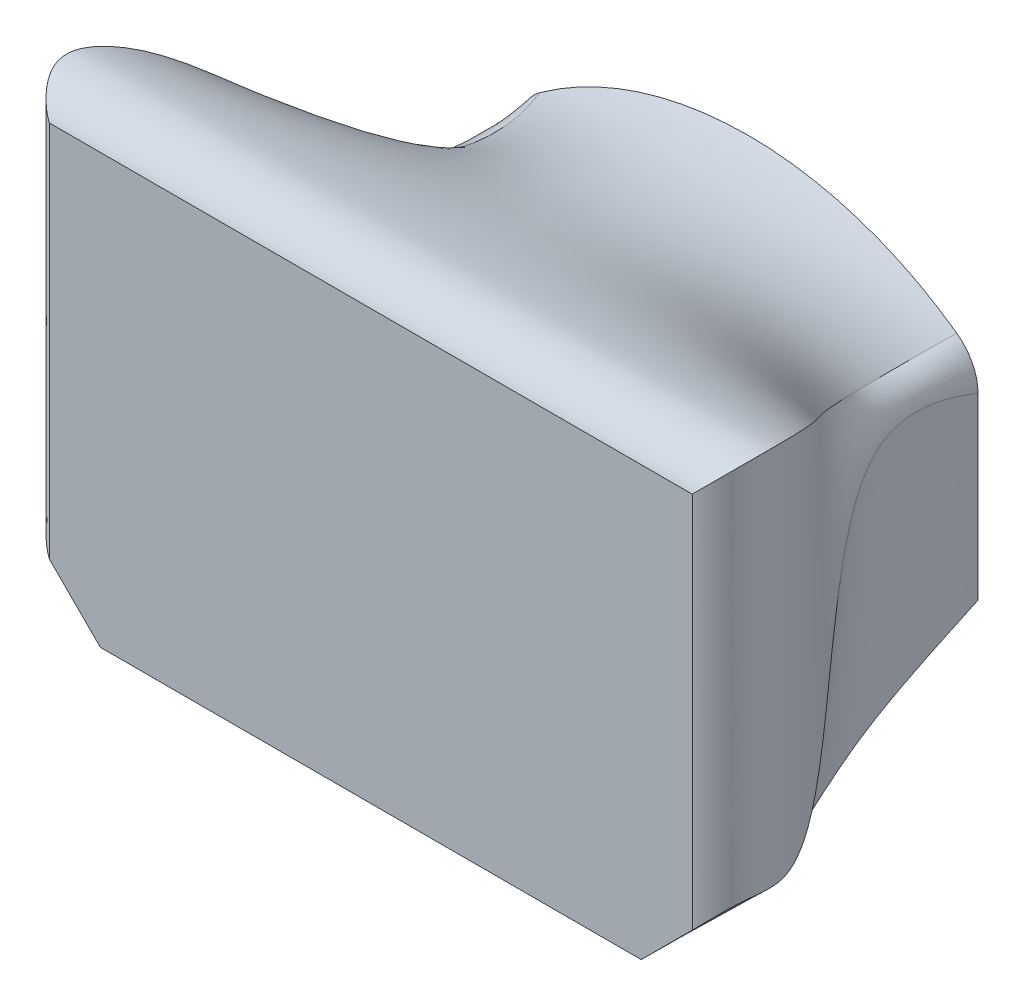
ISO-10303-21;
HEADER;
FILE_DESCRIPTION(('STEP AP214'),'2;1');
FILE_NAME('part.step','',(''),(''),'','','');
FILE_SCHEMA(('AUTOMOTIVE_DESIGN { 1 0 10303 214 1 1 1 1 }'));
ENDSEC;
DATA;
#1=APPLICATION_CONTEXT('core data for automotive mechanical design processes');
#2=APPLICATION_PROTOCOL_DEFINITION('international standard','automotive_design',2000,#1);
#3=PRODUCT_CONTEXT('',#1,'mechanical');
#4=PRODUCT('Part','Part','',(#3));
#5=PRODUCT_RELATED_PRODUCT_CATEGORY('part','',(#4));
#6=PRODUCT_DEFINITION_FORMATION('','',#4);
#7=PRODUCT_DEFINITION_CONTEXT('part definition',#1,'design');
#8=PRODUCT_DEFINITION('design','',#6,#7);
#9=PRODUCT_DEFINITION_SHAPE('','',#8);
#10=(LENGTH_UNIT() NAMED_UNIT(*) SI_UNIT(.MILLI.,.METRE.));
#11=(NAMED_UNIT(*) PLANE_ANGLE_UNIT() SI_UNIT($,.RADIAN.));
#12=(NAMED_UNIT(*) SI_UNIT($,.STERADIAN.) SOLID_ANGLE_UNIT());
#13=UNCERTAINTY_MEASURE_WITH_UNIT(LENGTH_MEASURE(1.E-05),#10,'distance_accuracy_value','');
#14=(GEOMETRIC_REPRESENTATION_CONTEXT(3) GLOBAL_UNCERTAINTY_ASSIGNED_CONTEXT((#13)) GLOBAL_UNIT_ASSIGNED_CONTEXT((#10,
#11,#12)) REPRESENTATION_CONTEXT('',''));
#15=CARTESIAN_POINT('',(0.,0.,0.));
#16=DIRECTION('',(0.,0.,1.));
#17=DIRECTION('',(1.,0.,0.));
#18=AXIS2_PLACEMENT_3D('',#15,#16,#17);
#19=CARTESIAN_POINT('',(17.5,27.5574726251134,-37.));
#20=DIRECTION('',(0.,0.,1.));
#21=DIRECTION('',(1.,0.,0.));
#22=AXIS2_PLACEMENT_3D('',#19,#20,#21);
#23=PLANE('',#22);
#24=CARTESIAN_POINT('',(17.5,27.5574726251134,-37.));
#25=DIRECTION('',(0.,0.,1.));
#26=DIRECTION('',(1.,0.,0.));
#27=AXIS2_PLACEMENT_3D('',#24,#25,#26);
#28=CIRCLE('',#27,5.);
#29=CARTESIAN_POINT('',(22.5,27.5574726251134,-37.));
#30=VERTEX_POINT('',#29);
#31=CARTESIAN_POINT('',(20.4166666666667,31.6186369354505,-37.));
#32=VERTEX_POINT('',#31);
#33=EDGE_CURVE('E124',#30,#32,#28,.T.);
#34=ORIENTED_EDGE('',*,*,#33,.F.);
#35=DIRECTION('',(0.,1.,0.));
#36=VECTOR('',#35,1.);
#37=CARTESIAN_POINT('',(22.5,27.5574726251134,-37.));
#38=LINE('',#37,#36);
#39=CARTESIAN_POINT('',(22.5,10.,-37.));
#40=VERTEX_POINT('',#39);
#41=EDGE_CURVE('E135',#40,#30,#38,.T.);
#42=ORIENTED_EDGE('',*,*,#41,.F.);
#43=DIRECTION('',(1.,0.,0.));
#44=VECTOR('',#43,1.);
#45=CARTESIAN_POINT('',(-22.5,10.,-37.));
#46=LINE('',#45,#44);
#47=CARTESIAN_POINT('',(-22.5,10.,-37.));
#48=VERTEX_POINT('',#47);
#49=EDGE_CURVE('E143',#48,#40,#46,.T.);
#50=ORIENTED_EDGE('',*,*,#49,.F.);
#51=DIRECTION('',(0.,-1.,0.));
#52=VECTOR('',#51,1.);
#53=CARTESIAN_POINT('',(-22.5,27.5574726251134,-37.));
#54=LINE('',#53,#52);
#55=CARTESIAN_POINT('',(-22.5,27.5574726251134,-37.));
#56=VERTEX_POINT('',#55);
#57=EDGE_CURVE('E164',#56,#48,#54,.T.);
#58=ORIENTED_EDGE('',*,*,#57,.F.);
#59=CARTESIAN_POINT('',(-17.5,27.5574726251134,-37.));
#60=DIRECTION('',(0.,0.,1.));
#61=DIRECTION('',(1.,0.,0.));
#62=AXIS2_PLACEMENT_3D('',#59,#60,#61);
#63=CIRCLE('',#62,5.);
#64=CARTESIAN_POINT('',(-20.4166666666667,31.6186369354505,-37.));
#65=VERTEX_POINT('',#64);
#66=EDGE_CURVE('E153',#65,#56,#63,.T.);
#67=ORIENTED_EDGE('',*,*,#66,.F.);
#68=CARTESIAN_POINT('',(0.,3.19048676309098,-37.));
#69=DIRECTION('',(0.,0.,1.));
#70=DIRECTION('',(1.,0.,0.));
#71=AXIS2_PLACEMENT_3D('',#68,#69,#70);
#72=CIRCLE('',#71,35.);
#73=EDGE_CURVE('E147',#32,#65,#72,.T.);
#74=ORIENTED_EDGE('',*,*,#73,.F.);
#75=EDGE_LOOP('',(#34,#42,#50,#58,#67,#74));
#76=FACE_BOUND('',#75,.T.);
#77=ADVANCED_FACE('F60',(#76),#23,.F.);
#78=CARTESIAN_POINT('',(0.,-26.5,0.));
#79=DIRECTION('',(0.,0.,-1.));
#80=DIRECTION('',(-1.,0.,0.));
#81=AXIS2_PLACEMENT_3D('',#78,#79,#80);
#82=PLANE('',#81);
#83=DIRECTION('',(0.707106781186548,-0.707106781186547,0.));
#84=VECTOR('',#83,1.);
#85=CARTESIAN_POINT('',(-31.5,5.,0.));
#86=LINE('',#85,#84);
#87=CARTESIAN_POINT('',(-31.5,5.,0.));
#88=VERTEX_POINT('',#87);
#89=CARTESIAN_POINT('',(-26.5,0.,0.));
#90=VERTEX_POINT('',#89);
#91=EDGE_CURVE('E199',#88,#90,#86,.T.);
#92=ORIENTED_EDGE('',*,*,#91,.T.);
#93=DIRECTION('',(1.,0.,0.));
#94=VECTOR('',#93,1.);
#95=CARTESIAN_POINT('',(-26.5,0.,0.));
#96=LINE('',#95,#94);
#97=CARTESIAN_POINT('',(26.5,0.,0.));
#98=VERTEX_POINT('',#97);
#99=EDGE_CURVE('E200',#90,#98,#96,.T.);
#100=ORIENTED_EDGE('',*,*,#99,.T.);
#101=DIRECTION('',(0.707106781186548,0.707106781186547,0.));
#102=VECTOR('',#101,1.);
#103=CARTESIAN_POINT('',(31.5,5.,0.));
#104=LINE('',#103,#102);
#105=CARTESIAN_POINT('',(31.5,5.,0.));
#106=VERTEX_POINT('',#105);
#107=EDGE_CURVE('E203',#98,#106,#104,.T.);
#108=ORIENTED_EDGE('',*,*,#107,.T.);
#109=DIRECTION('',(0.,1.,0.));
#110=VECTOR('',#109,1.);
#111=CARTESIAN_POINT('',(31.5,42.,0.));
#112=LINE('',#111,#110);
#113=CARTESIAN_POINT('',(31.5,42.,0.));
#114=VERTEX_POINT('',#113);
#115=EDGE_CURVE('E128',#106,#114,#112,.T.);
#116=ORIENTED_EDGE('',*,*,#115,.T.);
#117=DIRECTION('',(-1.,0.,0.));
#118=VECTOR('',#117,1.);
#119=CARTESIAN_POINT('',(-31.5,42.,0.));
#120=LINE('',#119,#118);
#121=CARTESIAN_POINT('',(-31.5,42.,0.));
#122=VERTEX_POINT('',#121);
#123=EDGE_CURVE('E72',#114,#122,#120,.T.);
#124=ORIENTED_EDGE('',*,*,#123,.T.);
#125=DIRECTION('',(0.,-1.,0.));
#126=VECTOR('',#125,1.);
#127=CARTESIAN_POINT('',(-31.5,42.,0.));
#128=LINE('',#127,#126);
#129=EDGE_CURVE('E12',#122,#88,#128,.T.);
#130=ORIENTED_EDGE('',*,*,#129,.T.);
#131=EDGE_LOOP('',(#92,#100,#108,#116,#124,#130));
#132=FACE_BOUND('',#131,.T.);
#133=ADVANCED_FACE('F62',(#132),#82,.F.);
#134=CARTESIAN_POINT('',(-31.5,42.,0.));
#135=CARTESIAN_POINT('',(-32.2173489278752,42.7173489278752,-0.288499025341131));
#136=CARTESIAN_POINT('',(-34.4651165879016,44.9681768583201,-2.52134921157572));
#137=CARTESIAN_POINT('',(-32.6325254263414,43.0790484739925,-14.235896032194));
#138=CARTESIAN_POINT('',(-19.0547960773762,30.3477492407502,-20.9502747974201));
#139=CARTESIAN_POINT('',(-19.7043413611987,30.9445305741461,-34.1889129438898));
#140=CARTESIAN_POINT('',(-20.4166666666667,31.6186369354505,-37.));
#141=CARTESIAN_POINT('',(-10.5,42.,0.));
#142=CARTESIAN_POINT('',(-10.7391163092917,42.7173489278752,-0.288499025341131));
#143=CARTESIAN_POINT('',(-11.4948827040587,45.0085277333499,-2.52134921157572));
#144=CARTESIAN_POINT('',(-10.7637400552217,42.3739337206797,-14.235896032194));
#145=CARTESIAN_POINT('',(-8.03855026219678,40.8031501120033,-20.9502747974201));
#146=CARTESIAN_POINT('',(-7.98154709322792,39.7047179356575,-34.1889129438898));
#147=CARTESIAN_POINT('',(-8.21898886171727,40.3788242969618,-37.));
#148=CARTESIAN_POINT('',(10.5,42.,0.));
#149=CARTESIAN_POINT('',(10.7391163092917,42.7173489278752,-0.288499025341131));
#150=CARTESIAN_POINT('',(11.4948827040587,45.0085277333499,-2.52134921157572));
#151=CARTESIAN_POINT('',(10.7637400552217,42.3739337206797,-14.235896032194));
#152=CARTESIAN_POINT('',(8.03855026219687,40.8031501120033,-20.9502747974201));
#153=CARTESIAN_POINT('',(7.98154709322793,39.7047179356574,-34.1889129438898));
#154=CARTESIAN_POINT('',(8.21898886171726,40.3788242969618,-37.));
#155=CARTESIAN_POINT('',(31.5,42.,0.));
#156=CARTESIAN_POINT('',(32.2173489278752,42.7173489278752,-0.288499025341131));
#157=CARTESIAN_POINT('',(34.4651165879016,44.9681768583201,-2.52134921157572));
#158=CARTESIAN_POINT('',(32.6325254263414,43.0790484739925,-14.235896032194));
#159=CARTESIAN_POINT('',(19.0547960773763,30.3477492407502,-20.9502747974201));
#160=CARTESIAN_POINT('',(19.7043413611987,30.9445305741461,-34.1889129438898));
#161=CARTESIAN_POINT('',(20.4166666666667,31.6186369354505,-37.));
#162=B_SPLINE_SURFACE_WITH_KNOTS('',3,3,((#134,#135,#136,#137,#138,#139,#140),(#141,#142,#143,
#144,#145,#146,#147),(#148,#149,#150,#151,#152,#153,#154),(#155,#156,#157,#158,#159,#160,#161)),
.UNSPECIFIED.,.F.,.F.,.F.,(4,4),(4,1,1,1,4),(0.,1.),(0.,0.0671229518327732,0.183817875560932,
0.758526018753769,1.),.UNSPECIFIED.);
#163=CARTESIAN_POINT('',(31.5,42.,0.));
#164=CARTESIAN_POINT('',(32.2173489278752,42.7173489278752,-0.288499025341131));
#165=CARTESIAN_POINT('',(34.4651165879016,44.9681768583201,-2.52134921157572));
#166=CARTESIAN_POINT('',(32.6325254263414,43.0790484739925,-14.235896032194));
#167=CARTESIAN_POINT('',(19.0547960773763,30.3477492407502,-20.9502747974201));
#168=CARTESIAN_POINT('',(19.7043413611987,30.9445305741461,-34.1889129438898));
#169=CARTESIAN_POINT('',(20.4166666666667,31.6186369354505,-37.));
#170=B_SPLINE_CURVE_WITH_KNOTS('',3,(#163,#164,#165,#166,#167,#168,#169),.UNSPECIFIED.,.F.,.F.,
(4,1,1,1,4),(0.,0.0671229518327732,0.183817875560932,0.758526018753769,1.),.UNSPECIFIED.);
#171=EDGE_CURVE('E320',#114,#32,#170,.T.);
#172=CARTESIAN_POINT('',(-31.5,42.,0.));
#173=CARTESIAN_POINT('',(-32.2173489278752,42.7173489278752,-0.288499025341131));
#174=CARTESIAN_POINT('',(-34.4651165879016,44.9681768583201,-2.52134921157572));
#175=CARTESIAN_POINT('',(-32.6325254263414,43.0790484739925,-14.235896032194));
#176=CARTESIAN_POINT('',(-19.0547960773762,30.3477492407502,-20.9502747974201));
#177=CARTESIAN_POINT('',(-19.7043413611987,30.9445305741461,-34.1889129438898));
#178=CARTESIAN_POINT('',(-20.4166666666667,31.6186369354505,-37.));
#179=B_SPLINE_CURVE_WITH_KNOTS('',3,(#172,#173,#174,#175,#176,#177,#178),.UNSPECIFIED.,.F.,.F.,
(4,1,1,1,4),(0.,0.0671229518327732,0.183817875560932,0.758526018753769,1.),.UNSPECIFIED.);
#180=EDGE_CURVE('E87',#65,#122,#179,.F.);
#181=ORIENTED_EDGE('',*,*,#123,.F.);
#182=ORIENTED_EDGE('',*,*,#171,.T.);
#183=ORIENTED_EDGE('',*,*,#73,.T.);
#184=ORIENTED_EDGE('',*,*,#180,.T.);
#185=EDGE_LOOP('',(#181,#182,#183,#184));
#186=FACE_BOUND('',#185,.T.);
#187=ADVANCED_FACE('F333',(#186),#162,.T.);
#188=CARTESIAN_POINT('',(31.5,42.,0.));
#189=CARTESIAN_POINT('',(32.2173489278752,42.7173489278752,-0.288499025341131));
#190=CARTESIAN_POINT('',(34.4651165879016,44.9681768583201,-2.52134921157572));
#191=CARTESIAN_POINT('',(32.6325254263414,43.0790484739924,-14.235896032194));
#192=CARTESIAN_POINT('',(19.0547960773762,30.3477492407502,-20.9502747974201));
#193=CARTESIAN_POINT('',(19.7043413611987,30.9445305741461,-34.1889129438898));
#194=CARTESIAN_POINT('',(20.4166666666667,31.6186369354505,-37.));
#195=CARTESIAN_POINT('',(31.5,29.6666666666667,0.));
#196=CARTESIAN_POINT('',(32.2173489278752,30.3840155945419,-0.288499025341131));
#197=CARTESIAN_POINT('',(34.4708316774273,32.6848755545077,-2.52172357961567));
#198=CARTESIAN_POINT('',(32.5326566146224,29.871426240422,-14.2293541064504));
#199=CARTESIAN_POINT('',(20.5356450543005,30.9783212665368,-21.0472780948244));
#200=CARTESIAN_POINT('',(21.0801848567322,30.5464922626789,-34.1062658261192));
#201=CARTESIAN_POINT('',(21.7243970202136,30.6794448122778,-37.));
#202=CARTESIAN_POINT('',(31.5,17.3333333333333,0.));
#203=CARTESIAN_POINT('',(32.2173489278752,18.0506822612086,-0.288499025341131));
#204=CARTESIAN_POINT('',(34.4740957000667,20.3989361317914,-2.52209794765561));
#205=CARTESIAN_POINT('',(32.4756191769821,16.7099040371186,-14.2228121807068));
#206=CARTESIAN_POINT('',(21.3813928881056,30.9253247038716,-21.1442813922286));
#207=CARTESIAN_POINT('',(21.9239009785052,29.5757175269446,-34.0236187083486));
#208=CARTESIAN_POINT('',(22.5,29.167516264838,-37.));
#209=CARTESIAN_POINT('',(31.5,5.,0.));
#210=CARTESIAN_POINT('',(32.2173489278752,5.71734892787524,-0.288499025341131));
#211=CARTESIAN_POINT('',(34.4737871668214,8.11254477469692,-2.52247231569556));
#212=CARTESIAN_POINT('',(32.4810106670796,3.556279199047,-14.2162702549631));
#213=CARTESIAN_POINT('',(21.3014481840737,30.755226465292,-21.2412846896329));
#214=CARTESIAN_POINT('',(21.9920141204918,28.5068276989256,-33.9409715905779));
#215=CARTESIAN_POINT('',(22.5,27.5574726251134,-37.));
#216=B_SPLINE_SURFACE_WITH_KNOTS('',3,3,((#188,#189,#190,#191,#192,#193,#194),(#195,#196,#197,
#198,#199,#200,#201),(#202,#203,#204,#205,#206,#207,#208),(#209,#210,#211,#212,#213,#214,#215)),
.UNSPECIFIED.,.F.,.F.,.F.,(4,4),(4,1,1,1,4),(0.,1.),(0.,0.0671229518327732,0.183817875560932,
0.758526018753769,1.),.UNSPECIFIED.);
#217=CARTESIAN_POINT('',(31.5,5.,0.));
#218=CARTESIAN_POINT('',(32.2173489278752,5.71734892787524,-0.288499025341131));
#219=CARTESIAN_POINT('',(34.4737871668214,8.11254477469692,-2.52247231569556));
#220=CARTESIAN_POINT('',(32.4810106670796,3.556279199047,-14.2162702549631));
#221=CARTESIAN_POINT('',(21.3014481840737,30.755226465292,-21.2412846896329));
#222=CARTESIAN_POINT('',(21.9920141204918,28.5068276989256,-33.9409715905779));
#223=CARTESIAN_POINT('',(22.5,27.5574726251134,-37.));
#224=B_SPLINE_CURVE_WITH_KNOTS('',3,(#217,#218,#219,#220,#221,#222,#223),.UNSPECIFIED.,.F.,.F.,
(4,1,1,1,4),(0.,0.0671229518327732,0.183817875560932,0.758526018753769,1.),.UNSPECIFIED.);
#225=EDGE_CURVE('E119',#106,#30,#224,.T.);
#226=ORIENTED_EDGE('',*,*,#115,.F.);
#227=ORIENTED_EDGE('',*,*,#225,.T.);
#228=ORIENTED_EDGE('',*,*,#33,.T.);
#229=ORIENTED_EDGE('',*,*,#171,.F.);
#230=EDGE_LOOP('',(#226,#227,#228,#229));
#231=FACE_BOUND('',#230,.T.);
#232=ADVANCED_FACE('F121',(#231),#216,.T.);
#233=CARTESIAN_POINT('',(-31.5,5.,0.));
#234=CARTESIAN_POINT('',(-32.2173489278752,5.71734892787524,-0.28849902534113));
#235=CARTESIAN_POINT('',(-34.4737871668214,8.11254477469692,-2.52247231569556));
#236=CARTESIAN_POINT('',(-32.4810106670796,3.55627919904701,-14.2162702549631));
#237=CARTESIAN_POINT('',(-21.3014481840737,30.755226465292,-21.2412846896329));
#238=CARTESIAN_POINT('',(-21.9920141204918,28.5068276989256,-33.9409715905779));
#239=CARTESIAN_POINT('',(-22.5,27.5574726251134,-37.));
#240=CARTESIAN_POINT('',(-31.5,17.3333333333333,0.));
#241=CARTESIAN_POINT('',(-32.2173489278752,18.0506822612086,-0.288499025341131));
#242=CARTESIAN_POINT('',(-34.4740957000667,20.3989361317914,-2.52209794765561));
#243=CARTESIAN_POINT('',(-32.4756191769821,16.7099040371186,-14.2228121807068));
#244=CARTESIAN_POINT('',(-21.3813928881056,30.9253247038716,-21.1442813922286));
#245=CARTESIAN_POINT('',(-21.9239009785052,29.5757175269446,-34.0236187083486));
#246=CARTESIAN_POINT('',(-22.5,29.167516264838,-37.));
#247=CARTESIAN_POINT('',(-31.5,29.6666666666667,0.));
#248=CARTESIAN_POINT('',(-32.2173489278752,30.3840155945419,-0.288499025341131));
#249=CARTESIAN_POINT('',(-34.4708316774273,32.6848755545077,-2.52172357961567));
#250=CARTESIAN_POINT('',(-32.5326566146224,29.871426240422,-14.2293541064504));
#251=CARTESIAN_POINT('',(-20.5356450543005,30.9783212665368,-21.0472780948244));
#252=CARTESIAN_POINT('',(-21.0801848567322,30.5464922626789,-34.1062658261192));
#253=CARTESIAN_POINT('',(-21.7243970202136,30.6794448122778,-37.));
#254=CARTESIAN_POINT('',(-31.5,42.,0.));
#255=CARTESIAN_POINT('',(-32.2173489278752,42.7173489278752,-0.288499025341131));
#256=CARTESIAN_POINT('',(-34.4651165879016,44.9681768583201,-2.52134921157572));
#257=CARTESIAN_POINT('',(-32.6325254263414,43.0790484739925,-14.235896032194));
#258=CARTESIAN_POINT('',(-19.0547960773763,30.3477492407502,-20.9502747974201));
#259=CARTESIAN_POINT('',(-19.7043413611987,30.9445305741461,-34.1889129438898));
#260=CARTESIAN_POINT('',(-20.4166666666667,31.6186369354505,-37.));
#261=B_SPLINE_SURFACE_WITH_KNOTS('',3,3,((#233,#234,#235,#236,#237,#238,#239),(#240,#241,#242,
#243,#244,#245,#246),(#247,#248,#249,#250,#251,#252,#253),(#254,#255,#256,#257,#258,#259,#260)),
.UNSPECIFIED.,.F.,.F.,.F.,(4,4),(4,1,1,1,4),(0.,1.),(0.,0.0671229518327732,0.183817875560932,
0.758526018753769,1.),.UNSPECIFIED.);
#262=CARTESIAN_POINT('',(-31.5,5.,0.));
#263=CARTESIAN_POINT('',(-32.2173489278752,5.71734892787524,-0.288499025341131));
#264=CARTESIAN_POINT('',(-34.4737871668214,8.11254477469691,-2.52247231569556));
#265=CARTESIAN_POINT('',(-32.4810106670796,3.556279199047,-14.2162702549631));
#266=CARTESIAN_POINT('',(-21.3014481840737,30.755226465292,-21.2412846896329));
#267=CARTESIAN_POINT('',(-21.9920141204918,28.5068276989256,-33.9409715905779));
#268=CARTESIAN_POINT('',(-22.5,27.5574726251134,-37.));
#269=B_SPLINE_CURVE_WITH_KNOTS('',3,(#262,#263,#264,#265,#266,#267,#268),.UNSPECIFIED.,.F.,.F.,
(4,1,1,1,4),(0.,0.0671229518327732,0.183817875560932,0.758526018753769,1.),.UNSPECIFIED.);
#270=EDGE_CURVE('E142',#88,#56,#269,.T.);
#271=ORIENTED_EDGE('',*,*,#129,.F.);
#272=ORIENTED_EDGE('',*,*,#180,.F.);
#273=ORIENTED_EDGE('',*,*,#66,.T.);
#274=ORIENTED_EDGE('',*,*,#270,.F.);
#275=EDGE_LOOP('',(#271,#272,#273,#274));
#276=FACE_BOUND('',#275,.T.);
#277=ADVANCED_FACE('F279',(#276),#261,.T.);
#278=CARTESIAN_POINT('',(31.5,5.,0.));
#279=CARTESIAN_POINT('',(32.2173489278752,5.71734892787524,-0.288499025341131));
#280=CARTESIAN_POINT('',(34.4737871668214,8.11254477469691,-2.52247231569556));
#281=CARTESIAN_POINT('',(32.4810106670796,3.55627919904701,-14.2162702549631));
#282=CARTESIAN_POINT('',(21.3014481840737,30.755226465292,-21.2412846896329));
#283=CARTESIAN_POINT('',(21.9920141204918,28.5068276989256,-33.9409715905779));
#284=CARTESIAN_POINT('',(22.5,27.5574726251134,-37.));
#285=CARTESIAN_POINT('',(26.5,0.,0.));
#286=CARTESIAN_POINT('',(26.5,0.,-0.444444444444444));
#287=CARTESIAN_POINT('',(26.4829623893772,0.0069806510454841,-2.39407092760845));
#288=CARTESIAN_POINT('',(26.7977251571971,-0.121983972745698,-14.5150418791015));
#289=CARTESIAN_POINT('',(22.0853485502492,1.80877130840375,-20.1312459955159));
#290=CARTESIAN_POINT('',(22.1937882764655,8.54330708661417,-34.8521434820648));
#291=CARTESIAN_POINT('',(22.5,10.,-37.));
#292=B_SPLINE_SURFACE_WITH_KNOTS('',1,3,((#278,#279,#280,#281,#282,#283,#284),(#285,#286,#287,
#288,#289,#290,#291)),.UNSPECIFIED.,.F.,.F.,.F.,(2,2),(4,1,1,1,4),(0.,1.),(0.,
0.0671229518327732,0.183817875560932,0.758526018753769,1.),.UNSPECIFIED.);
#293=CARTESIAN_POINT('',(26.5,0.,0.));
#294=CARTESIAN_POINT('',(26.5,0.,-0.444444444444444));
#295=CARTESIAN_POINT('',(26.4829623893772,0.0069806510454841,-2.39407092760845));
#296=CARTESIAN_POINT('',(26.7977251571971,-0.121983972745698,-14.5150418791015));
#297=CARTESIAN_POINT('',(22.0853485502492,1.80877130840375,-20.1312459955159));
#298=CARTESIAN_POINT('',(22.1937882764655,8.54330708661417,-34.8521434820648));
#299=CARTESIAN_POINT('',(22.5,10.,-37.));
#300=B_SPLINE_CURVE_WITH_KNOTS('',3,(#293,#294,#295,#296,#297,#298,#299),.UNSPECIFIED.,.F.,.F.,
(4,1,1,1,4),(0.,0.0671229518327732,0.183817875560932,0.758526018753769,1.),.UNSPECIFIED.);
#301=EDGE_CURVE('E132',#98,#40,#300,.T.);
#302=ORIENTED_EDGE('',*,*,#107,.F.);
#303=ORIENTED_EDGE('',*,*,#301,.T.);
#304=ORIENTED_EDGE('',*,*,#41,.T.);
#305=ORIENTED_EDGE('',*,*,#225,.F.);
#306=EDGE_LOOP('',(#302,#303,#304,#305));
#307=FACE_BOUND('',#306,.T.);
#308=ADVANCED_FACE('F137',(#307),#292,.T.);
#309=CARTESIAN_POINT('',(26.5,0.,0.));
#310=CARTESIAN_POINT('',(26.5,0.,-0.444444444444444));
#311=CARTESIAN_POINT('',(26.4829623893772,0.00698065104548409,-2.39407092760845));
#312=CARTESIAN_POINT('',(26.7977251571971,-0.121983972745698,-14.5150418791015));
#313=CARTESIAN_POINT('',(22.0853485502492,1.80877130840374,-20.1312459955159));
#314=CARTESIAN_POINT('',(22.1937882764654,8.54330708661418,-34.8521434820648));
#315=CARTESIAN_POINT('',(22.5,10.,-37.));
#316=CARTESIAN_POINT('',(-26.5,0.,0.));
#317=CARTESIAN_POINT('',(-26.5,0.,-0.444444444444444));
#318=CARTESIAN_POINT('',(-26.4829623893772,0.00698065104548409,-2.39407092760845));
#319=CARTESIAN_POINT('',(-26.7977251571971,-0.121983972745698,-14.5150418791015));
#320=CARTESIAN_POINT('',(-22.0853485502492,1.80877130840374,-20.1312459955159));
#321=CARTESIAN_POINT('',(-22.1937882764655,8.54330708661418,-34.8521434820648));
#322=CARTESIAN_POINT('',(-22.5,10.,-37.));
#323=B_SPLINE_SURFACE_WITH_KNOTS('',1,3,((#309,#310,#311,#312,#313,#314,#315),(#316,#317,#318,
#319,#320,#321,#322)),.UNSPECIFIED.,.F.,.F.,.F.,(2,2),(4,1,1,1,4),(0.,1.),(0.,
0.0671229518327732,0.183817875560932,0.758526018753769,1.),.UNSPECIFIED.);
#324=CARTESIAN_POINT('',(-26.5,0.,0.));
#325=CARTESIAN_POINT('',(-26.5,0.,-0.444444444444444));
#326=CARTESIAN_POINT('',(-26.4829623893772,0.00698065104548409,-2.39407092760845));
#327=CARTESIAN_POINT('',(-26.7977251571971,-0.121983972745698,-14.5150418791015));
#328=CARTESIAN_POINT('',(-22.0853485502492,1.80877130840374,-20.1312459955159));
#329=CARTESIAN_POINT('',(-22.1937882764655,8.54330708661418,-34.8521434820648));
#330=CARTESIAN_POINT('',(-22.5,10.,-37.));
#331=B_SPLINE_CURVE_WITH_KNOTS('',3,(#324,#325,#326,#327,#328,#329,#330),.UNSPECIFIED.,.F.,.F.,
(4,1,1,1,4),(0.,0.0671229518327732,0.183817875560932,0.758526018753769,1.),.UNSPECIFIED.);
#332=EDGE_CURVE('E217',#90,#48,#331,.T.);
#333=ORIENTED_EDGE('',*,*,#99,.F.);
#334=ORIENTED_EDGE('',*,*,#332,.T.);
#335=ORIENTED_EDGE('',*,*,#49,.T.);
#336=ORIENTED_EDGE('',*,*,#301,.F.);
#337=EDGE_LOOP('',(#333,#334,#335,#336));
#338=FACE_BOUND('',#337,.T.);
#339=ADVANCED_FACE('F216',(#338),#323,.T.);
#340=CARTESIAN_POINT('',(-26.5,0.,0.));
#341=CARTESIAN_POINT('',(-26.5,0.,-0.444444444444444));
#342=CARTESIAN_POINT('',(-26.4829623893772,0.00698065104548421,-2.39407092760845));
#343=CARTESIAN_POINT('',(-26.7977251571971,-0.121983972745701,-14.5150418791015));
#344=CARTESIAN_POINT('',(-22.0853485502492,1.80877130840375,-20.1312459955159));
#345=CARTESIAN_POINT('',(-22.1937882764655,8.54330708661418,-34.8521434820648));
#346=CARTESIAN_POINT('',(-22.5,10.,-37.));
#347=CARTESIAN_POINT('',(-31.5,5.,0.));
#348=CARTESIAN_POINT('',(-32.2173489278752,5.71734892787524,-0.288499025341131));
#349=CARTESIAN_POINT('',(-34.4737871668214,8.11254477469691,-2.52247231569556));
#350=CARTESIAN_POINT('',(-32.4810106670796,3.556279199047,-14.2162702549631));
#351=CARTESIAN_POINT('',(-21.3014481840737,30.755226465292,-21.2412846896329));
#352=CARTESIAN_POINT('',(-21.9920141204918,28.5068276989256,-33.9409715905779));
#353=CARTESIAN_POINT('',(-22.5,27.5574726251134,-37.));
#354=B_SPLINE_SURFACE_WITH_KNOTS('',1,3,((#340,#341,#342,#343,#344,#345,#346),(#347,#348,#349,
#350,#351,#352,#353)),.UNSPECIFIED.,.F.,.F.,.F.,(2,2),(4,1,1,1,4),(0.,1.),(0.,
0.0671229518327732,0.183817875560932,0.758526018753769,1.),.UNSPECIFIED.);
#355=ORIENTED_EDGE('',*,*,#91,.F.);
#356=ORIENTED_EDGE('',*,*,#270,.T.);
#357=ORIENTED_EDGE('',*,*,#57,.T.);
#358=ORIENTED_EDGE('',*,*,#332,.F.);
#359=EDGE_LOOP('',(#355,#356,#357,#358));
#360=FACE_BOUND('',#359,.T.);
#361=ADVANCED_FACE('F221',(#360),#354,.T.);
#362=CLOSED_SHELL('',(#77,#133,#187,#232,#277,#308,#339,#361));
#363=MANIFOLD_SOLID_BREP('B2',#362);
#364=ADVANCED_BREP_SHAPE_REPRESENTATION('',(#18,#363),#14);
#365=SHAPE_DEFINITION_REPRESENTATION(#9,#364);
ENDSEC;
END-ISO-10303-21;
